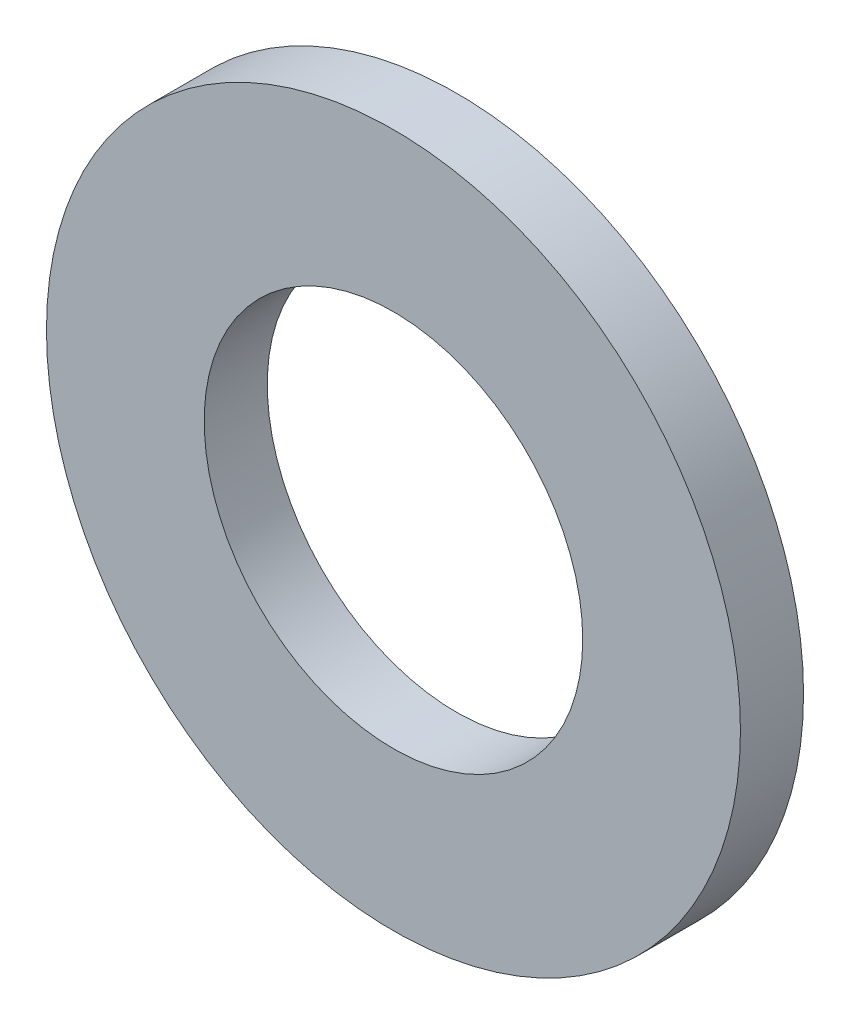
from build123d import *

# Parameters (mm, degrees)
SKETCH1_R           = 8.73125
SKETCH1_R_2         = 4.7625
BOSS_EXTRUDE1_DEPTH = 1.5875


with BuildPart() as part:
    # Sketch1 → Boss-Extrude1 (new body)
    with BuildSketch(Plane.XY):
        Circle(SKETCH1_R)
        Circle(SKETCH1_R_2, mode=Mode.SUBTRACT)
    extrude(amount=BOSS_EXTRUDE1_DEPTH)


solid = part.part
